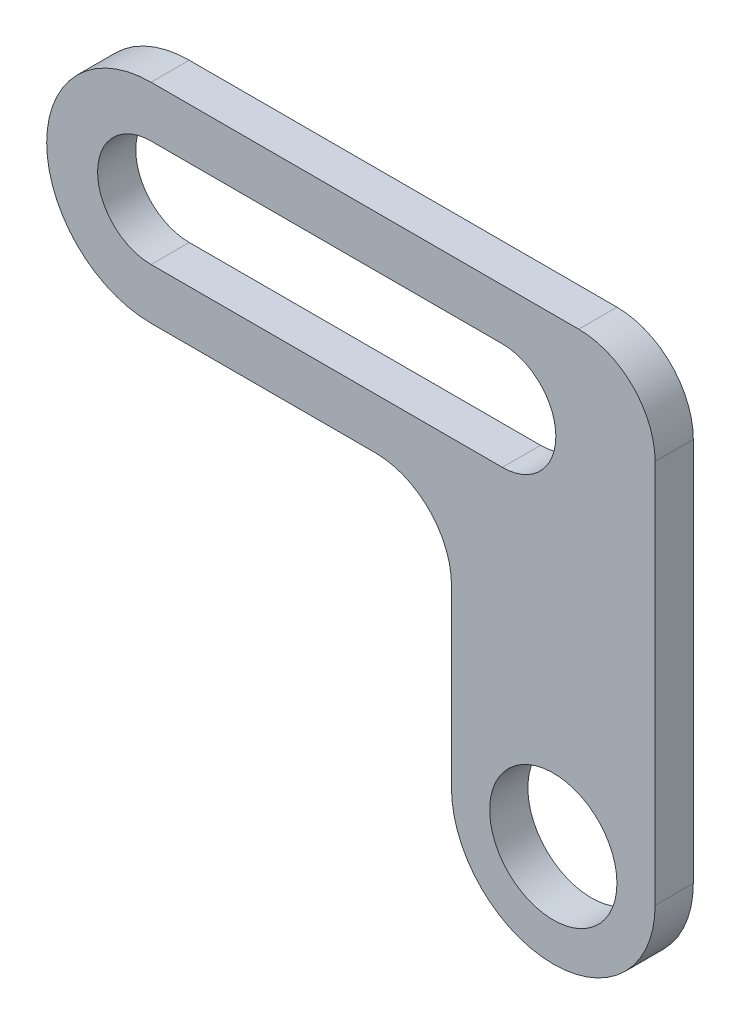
ISO-10303-21;
HEADER;
FILE_DESCRIPTION(('STEP AP214'),'2;1');
FILE_NAME('part.step','',(''),(''),'','','');
FILE_SCHEMA(('AUTOMOTIVE_DESIGN { 1 0 10303 214 1 1 1 1 }'));
ENDSEC;
DATA;
#1=APPLICATION_CONTEXT('core data for automotive mechanical design processes');
#2=APPLICATION_PROTOCOL_DEFINITION('international standard','automotive_design',2000,#1);
#3=PRODUCT_CONTEXT('',#1,'mechanical');
#4=PRODUCT('Part','Part','',(#3));
#5=PRODUCT_RELATED_PRODUCT_CATEGORY('part','',(#4));
#6=PRODUCT_DEFINITION_FORMATION('','',#4);
#7=PRODUCT_DEFINITION_CONTEXT('part definition',#1,'design');
#8=PRODUCT_DEFINITION('design','',#6,#7);
#9=PRODUCT_DEFINITION_SHAPE('','',#8);
#10=(LENGTH_UNIT() NAMED_UNIT(*) SI_UNIT(.MILLI.,.METRE.));
#11=(NAMED_UNIT(*) PLANE_ANGLE_UNIT() SI_UNIT($,.RADIAN.));
#12=(NAMED_UNIT(*) SI_UNIT($,.STERADIAN.) SOLID_ANGLE_UNIT());
#13=UNCERTAINTY_MEASURE_WITH_UNIT(LENGTH_MEASURE(1.E-05),#10,'distance_accuracy_value','');
#14=(GEOMETRIC_REPRESENTATION_CONTEXT(3) GLOBAL_UNCERTAINTY_ASSIGNED_CONTEXT((#13)) GLOBAL_UNIT_ASSIGNED_CONTEXT((#10,
#11,#12)) REPRESENTATION_CONTEXT('',''));
#15=CARTESIAN_POINT('',(0.,0.,0.));
#16=DIRECTION('',(0.,0.,1.));
#17=DIRECTION('',(1.,0.,0.));
#18=AXIS2_PLACEMENT_3D('',#15,#16,#17);
#19=CARTESIAN_POINT('',(0.,0.,15.));
#20=DIRECTION('',(0.,0.,1.));
#21=DIRECTION('',(1.,0.,0.));
#22=AXIS2_PLACEMENT_3D('',#19,#20,#21);
#23=PLANE('',#22);
#24=DIRECTION('',(1.,0.,0.));
#25=VECTOR('',#24,1.);
#26=CARTESIAN_POINT('',(-158.,119.,15.));
#27=LINE('',#26,#25);
#28=CARTESIAN_POINT('',(-158.,119.,15.));
#29=VERTEX_POINT('',#28);
#30=CARTESIAN_POINT('',(-20.,119.,15.));
#31=VERTEX_POINT('',#30);
#32=EDGE_CURVE('E132',#29,#31,#27,.T.);
#33=ORIENTED_EDGE('',*,*,#32,.F.);
#34=CARTESIAN_POINT('',(-158.,140.,15.));
#35=DIRECTION('',(0.,0.,1.));
#36=DIRECTION('',(1.,0.,0.));
#37=AXIS2_PLACEMENT_3D('',#34,#35,#36);
#38=CIRCLE('',#37,21.);
#39=CARTESIAN_POINT('',(-158.,161.,15.));
#40=VERTEX_POINT('',#39);
#41=EDGE_CURVE('E122',#40,#29,#38,.T.);
#42=ORIENTED_EDGE('',*,*,#41,.F.);
#43=DIRECTION('',(-1.,0.,0.));
#44=VECTOR('',#43,1.);
#45=CARTESIAN_POINT('',(-158.,161.,15.));
#46=LINE('',#45,#44);
#47=CARTESIAN_POINT('',(-20.,161.,15.));
#48=VERTEX_POINT('',#47);
#49=EDGE_CURVE('E148',#48,#40,#46,.T.);
#50=ORIENTED_EDGE('',*,*,#49,.F.);
#51=CARTESIAN_POINT('',(-20.,140.,15.));
#52=DIRECTION('',(0.,0.,1.));
#53=DIRECTION('',(1.,0.,0.));
#54=AXIS2_PLACEMENT_3D('',#51,#52,#53);
#55=CIRCLE('',#54,21.);
#56=EDGE_CURVE('E146',#31,#48,#55,.T.);
#57=ORIENTED_EDGE('',*,*,#56,.F.);
#58=EDGE_LOOP('',(#33,#42,#50,#57));
#59=FACE_BOUND('',#58,.T.);
#60=DIRECTION('',(0.,1.,0.));
#61=VECTOR('',#60,1.);
#62=CARTESIAN_POINT('',(40.,0.,15.));
#63=LINE('',#62,#61);
#64=CARTESIAN_POINT('',(40.,0.,15.));
#65=VERTEX_POINT('',#64);
#66=CARTESIAN_POINT('',(40.,151.,15.));
#67=VERTEX_POINT('',#66);
#68=EDGE_CURVE('E169',#65,#67,#63,.T.);
#69=ORIENTED_EDGE('',*,*,#68,.T.);
#70=CARTESIAN_POINT('',(10.,151.,15.));
#71=DIRECTION('',(0.,0.,1.));
#72=DIRECTION('',(1.,0.,0.));
#73=AXIS2_PLACEMENT_3D('',#70,#71,#72);
#74=CIRCLE('',#73,30.);
#75=CARTESIAN_POINT('',(10.,181.,15.));
#76=VERTEX_POINT('',#75);
#77=EDGE_CURVE('E215',#67,#76,#74,.T.);
#78=ORIENTED_EDGE('',*,*,#77,.T.);
#79=DIRECTION('',(-1.,0.,0.));
#80=VECTOR('',#79,1.);
#81=CARTESIAN_POINT('',(40.,181.,15.));
#82=LINE('',#81,#80);
#83=CARTESIAN_POINT('',(-158.,181.,15.));
#84=VERTEX_POINT('',#83);
#85=EDGE_CURVE('E172',#76,#84,#82,.T.);
#86=ORIENTED_EDGE('',*,*,#85,.T.);
#87=CARTESIAN_POINT('',(-158.,140.,15.));
#88=DIRECTION('',(0.,0.,1.));
#89=DIRECTION('',(1.,0.,0.));
#90=AXIS2_PLACEMENT_3D('',#87,#88,#89);
#91=CIRCLE('',#90,40.9999999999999);
#92=CARTESIAN_POINT('',(-158.,99.0000000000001,15.));
#93=VERTEX_POINT('',#92);
#94=EDGE_CURVE('E174',#84,#93,#91,.T.);
#95=ORIENTED_EDGE('',*,*,#94,.T.);
#96=DIRECTION('',(1.,0.,0.));
#97=VECTOR('',#96,1.);
#98=CARTESIAN_POINT('',(-158.,99.0000000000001,15.));
#99=LINE('',#98,#97);
#100=CARTESIAN_POINT('',(-70.,99.0000000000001,15.));
#101=VERTEX_POINT('',#100);
#102=EDGE_CURVE('E176',#93,#101,#99,.T.);
#103=ORIENTED_EDGE('',*,*,#102,.T.);
#104=CARTESIAN_POINT('',(-70.,69.0000000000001,15.));
#105=DIRECTION('',(0.,0.,1.));
#106=DIRECTION('',(1.,0.,0.));
#107=AXIS2_PLACEMENT_3D('',#104,#105,#106);
#108=CIRCLE('',#107,30.);
#109=CARTESIAN_POINT('',(-40.,69.0000000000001,15.));
#110=VERTEX_POINT('',#109);
#111=EDGE_CURVE('E11',#101,#110,#108,.F.);
#112=ORIENTED_EDGE('',*,*,#111,.T.);
#113=DIRECTION('',(0.,-1.,0.));
#114=VECTOR('',#113,1.);
#115=CARTESIAN_POINT('',(-40.,99.0000000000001,15.));
#116=LINE('',#115,#114);
#117=CARTESIAN_POINT('',(-40.,0.,15.));
#118=VERTEX_POINT('',#117);
#119=EDGE_CURVE('E179',#110,#118,#116,.T.);
#120=ORIENTED_EDGE('',*,*,#119,.T.);
#121=CARTESIAN_POINT('',(0.,0.,15.));
#122=DIRECTION('',(0.,0.,1.));
#123=DIRECTION('',(1.,0.,0.));
#124=AXIS2_PLACEMENT_3D('',#121,#122,#123);
#125=CIRCLE('',#124,40.);
#126=EDGE_CURVE('E166',#118,#65,#125,.T.);
#127=ORIENTED_EDGE('',*,*,#126,.T.);
#128=EDGE_LOOP('',(#69,#78,#86,#95,#103,#112,#120,#127));
#129=FACE_BOUND('',#128,.T.);
#130=CARTESIAN_POINT('',(0.,0.,15.));
#131=DIRECTION('',(0.,0.,1.));
#132=DIRECTION('',(1.,0.,0.));
#133=AXIS2_PLACEMENT_3D('',#130,#131,#132);
#134=CIRCLE('',#133,25.);
#135=CARTESIAN_POINT('',(25.,0.,15.));
#136=VERTEX_POINT('',#135);
#137=EDGE_CURVE('E155',#136,#136,#134,.T.);
#138=ORIENTED_EDGE('',*,*,#137,.F.);
#139=EDGE_LOOP('',(#138));
#140=FACE_BOUND('',#139,.T.);
#141=ADVANCED_FACE('F33',(#59,#129,#140),#23,.T.);
#142=CARTESIAN_POINT('',(0.,0.,0.));
#143=DIRECTION('',(0.,0.,1.));
#144=DIRECTION('',(1.,0.,0.));
#145=AXIS2_PLACEMENT_3D('',#142,#143,#144);
#146=PLANE('',#145);
#147=DIRECTION('',(-1.,0.,0.));
#148=VECTOR('',#147,1.);
#149=CARTESIAN_POINT('',(40.,181.,0.));
#150=LINE('',#149,#148);
#151=CARTESIAN_POINT('',(10.,181.,0.));
#152=VERTEX_POINT('',#151);
#153=CARTESIAN_POINT('',(-158.,181.,0.));
#154=VERTEX_POINT('',#153);
#155=EDGE_CURVE('E186',#152,#154,#150,.T.);
#156=ORIENTED_EDGE('',*,*,#155,.F.);
#157=CARTESIAN_POINT('',(10.,151.,0.));
#158=DIRECTION('',(0.,0.,1.));
#159=DIRECTION('',(1.,0.,0.));
#160=AXIS2_PLACEMENT_3D('',#157,#158,#159);
#161=CIRCLE('',#160,30.);
#162=CARTESIAN_POINT('',(40.,151.,0.));
#163=VERTEX_POINT('',#162);
#164=EDGE_CURVE('E56',#152,#163,#161,.F.);
#165=ORIENTED_EDGE('',*,*,#164,.T.);
#166=DIRECTION('',(0.,1.,0.));
#167=VECTOR('',#166,1.);
#168=CARTESIAN_POINT('',(40.,0.,0.));
#169=LINE('',#168,#167);
#170=CARTESIAN_POINT('',(40.,0.,0.));
#171=VERTEX_POINT('',#170);
#172=EDGE_CURVE('E184',#171,#163,#169,.T.);
#173=ORIENTED_EDGE('',*,*,#172,.F.);
#174=CARTESIAN_POINT('',(0.,0.,0.));
#175=DIRECTION('',(0.,0.,1.));
#176=DIRECTION('',(1.,0.,0.));
#177=AXIS2_PLACEMENT_3D('',#174,#175,#176);
#178=CIRCLE('',#177,40.);
#179=CARTESIAN_POINT('',(-40.,0.,0.));
#180=VERTEX_POINT('',#179);
#181=EDGE_CURVE('E140',#180,#171,#178,.T.);
#182=ORIENTED_EDGE('',*,*,#181,.F.);
#183=DIRECTION('',(0.,-1.,0.));
#184=VECTOR('',#183,1.);
#185=CARTESIAN_POINT('',(-40.,99.0000000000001,0.));
#186=LINE('',#185,#184);
#187=CARTESIAN_POINT('',(-40.,69.0000000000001,0.));
#188=VERTEX_POINT('',#187);
#189=EDGE_CURVE('E170',#188,#180,#186,.T.);
#190=ORIENTED_EDGE('',*,*,#189,.F.);
#191=CARTESIAN_POINT('',(-70.,69.0000000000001,0.));
#192=DIRECTION('',(0.,0.,1.));
#193=DIRECTION('',(1.,0.,0.));
#194=AXIS2_PLACEMENT_3D('',#191,#192,#193);
#195=CIRCLE('',#194,30.);
#196=CARTESIAN_POINT('',(-70.,99.0000000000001,0.));
#197=VERTEX_POINT('',#196);
#198=EDGE_CURVE('E41',#188,#197,#195,.T.);
#199=ORIENTED_EDGE('',*,*,#198,.T.);
#200=DIRECTION('',(1.,0.,0.));
#201=VECTOR('',#200,1.);
#202=CARTESIAN_POINT('',(-158.,99.0000000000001,0.));
#203=LINE('',#202,#201);
#204=CARTESIAN_POINT('',(-158.,99.0000000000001,0.));
#205=VERTEX_POINT('',#204);
#206=EDGE_CURVE('E190',#205,#197,#203,.T.);
#207=ORIENTED_EDGE('',*,*,#206,.F.);
#208=CARTESIAN_POINT('',(-158.,140.,0.));
#209=DIRECTION('',(0.,0.,1.));
#210=DIRECTION('',(1.,0.,0.));
#211=AXIS2_PLACEMENT_3D('',#208,#209,#210);
#212=CIRCLE('',#211,40.9999999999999);
#213=EDGE_CURVE('E188',#154,#205,#212,.T.);
#214=ORIENTED_EDGE('',*,*,#213,.F.);
#215=EDGE_LOOP('',(#156,#165,#173,#182,#190,#199,#207,#214));
#216=FACE_BOUND('',#215,.T.);
#217=CARTESIAN_POINT('',(-158.,140.,0.));
#218=DIRECTION('',(0.,0.,1.));
#219=DIRECTION('',(1.,0.,0.));
#220=AXIS2_PLACEMENT_3D('',#217,#218,#219);
#221=CIRCLE('',#220,21.);
#222=CARTESIAN_POINT('',(-158.,161.,0.));
#223=VERTEX_POINT('',#222);
#224=CARTESIAN_POINT('',(-158.,119.,0.));
#225=VERTEX_POINT('',#224);
#226=EDGE_CURVE('E153',#223,#225,#221,.T.);
#227=ORIENTED_EDGE('',*,*,#226,.T.);
#228=DIRECTION('',(1.,0.,0.));
#229=VECTOR('',#228,1.);
#230=CARTESIAN_POINT('',(-158.,119.,0.));
#231=LINE('',#230,#229);
#232=CARTESIAN_POINT('',(-20.,119.,0.));
#233=VERTEX_POINT('',#232);
#234=EDGE_CURVE('E139',#225,#233,#231,.T.);
#235=ORIENTED_EDGE('',*,*,#234,.T.);
#236=CARTESIAN_POINT('',(-20.,140.,0.));
#237=DIRECTION('',(0.,0.,1.));
#238=DIRECTION('',(1.,0.,0.));
#239=AXIS2_PLACEMENT_3D('',#236,#237,#238);
#240=CIRCLE('',#239,21.);
#241=CARTESIAN_POINT('',(-20.,161.,0.));
#242=VERTEX_POINT('',#241);
#243=EDGE_CURVE('E157',#233,#242,#240,.T.);
#244=ORIENTED_EDGE('',*,*,#243,.T.);
#245=DIRECTION('',(-1.,0.,0.));
#246=VECTOR('',#245,1.);
#247=CARTESIAN_POINT('',(-158.,161.,0.));
#248=LINE('',#247,#246);
#249=EDGE_CURVE('E133',#242,#223,#248,.T.);
#250=ORIENTED_EDGE('',*,*,#249,.T.);
#251=EDGE_LOOP('',(#227,#235,#244,#250));
#252=FACE_BOUND('',#251,.T.);
#253=CARTESIAN_POINT('',(0.,0.,0.));
#254=DIRECTION('',(0.,0.,1.));
#255=DIRECTION('',(1.,0.,0.));
#256=AXIS2_PLACEMENT_3D('',#253,#254,#255);
#257=CIRCLE('',#256,25.);
#258=CARTESIAN_POINT('',(25.,0.,0.));
#259=VERTEX_POINT('',#258);
#260=EDGE_CURVE('E297',#259,#259,#257,.T.);
#261=ORIENTED_EDGE('',*,*,#260,.T.);
#262=EDGE_LOOP('',(#261));
#263=FACE_BOUND('',#262,.T.);
#264=ADVANCED_FACE('F218',(#216,#252,#263),#146,.F.);
#265=CARTESIAN_POINT('',(0.,0.,15.));
#266=DIRECTION('',(0.,0.,-1.));
#267=DIRECTION('',(-1.,0.,0.));
#268=AXIS2_PLACEMENT_3D('',#265,#266,#267);
#269=CYLINDRICAL_SURFACE('',#268,40.);
#270=ORIENTED_EDGE('',*,*,#181,.T.);
#271=DIRECTION('',(0.,0.,-1.));
#272=VECTOR('',#271,1.);
#273=CARTESIAN_POINT('',(40.,0.,15.));
#274=LINE('',#273,#272);
#275=EDGE_CURVE('E202',#65,#171,#274,.T.);
#276=ORIENTED_EDGE('',*,*,#275,.F.);
#277=ORIENTED_EDGE('',*,*,#126,.F.);
#278=DIRECTION('',(0.,0.,-1.));
#279=VECTOR('',#278,1.);
#280=CARTESIAN_POINT('',(-40.,0.,15.));
#281=LINE('',#280,#279);
#282=EDGE_CURVE('E181',#118,#180,#281,.T.);
#283=ORIENTED_EDGE('',*,*,#282,.T.);
#284=EDGE_LOOP('',(#270,#276,#277,#283));
#285=FACE_BOUND('',#284,.T.);
#286=ADVANCED_FACE('F239',(#285),#269,.T.);
#287=CARTESIAN_POINT('',(40.,0.,15.));
#288=DIRECTION('',(-1.,0.,0.));
#289=DIRECTION('',(0.,-1.,0.));
#290=AXIS2_PLACEMENT_3D('',#287,#288,#289);
#291=PLANE('',#290);
#292=ORIENTED_EDGE('',*,*,#172,.T.);
#293=DIRECTION('',(0.,0.,-1.));
#294=VECTOR('',#293,1.);
#295=CARTESIAN_POINT('',(40.,151.,15.));
#296=LINE('',#295,#294);
#297=EDGE_CURVE('E48',#163,#67,#296,.F.);
#298=ORIENTED_EDGE('',*,*,#297,.T.);
#299=ORIENTED_EDGE('',*,*,#68,.F.);
#300=ORIENTED_EDGE('',*,*,#275,.T.);
#301=EDGE_LOOP('',(#292,#298,#299,#300));
#302=FACE_BOUND('',#301,.T.);
#303=ADVANCED_FACE('F257',(#302),#291,.F.);
#304=CARTESIAN_POINT('',(40.,181.,15.));
#305=DIRECTION('',(0.,-1.,0.));
#306=DIRECTION('',(1.,0.,0.));
#307=AXIS2_PLACEMENT_3D('',#304,#305,#306);
#308=PLANE('',#307);
#309=ORIENTED_EDGE('',*,*,#85,.F.);
#310=DIRECTION('',(0.,0.,-1.));
#311=VECTOR('',#310,1.);
#312=CARTESIAN_POINT('',(10.,181.,15.));
#313=LINE('',#312,#311);
#314=EDGE_CURVE('E210',#76,#152,#313,.T.);
#315=ORIENTED_EDGE('',*,*,#314,.T.);
#316=ORIENTED_EDGE('',*,*,#155,.T.);
#317=DIRECTION('',(0.,0.,-1.));
#318=VECTOR('',#317,1.);
#319=CARTESIAN_POINT('',(-158.,181.,15.));
#320=LINE('',#319,#318);
#321=EDGE_CURVE('E199',#84,#154,#320,.T.);
#322=ORIENTED_EDGE('',*,*,#321,.F.);
#323=EDGE_LOOP('',(#309,#315,#316,#322));
#324=FACE_BOUND('',#323,.T.);
#325=ADVANCED_FACE('F245',(#324),#308,.F.);
#326=CARTESIAN_POINT('',(-158.,140.,15.));
#327=DIRECTION('',(0.,0.,-1.));
#328=DIRECTION('',(-1.,0.,0.));
#329=AXIS2_PLACEMENT_3D('',#326,#327,#328);
#330=CYLINDRICAL_SURFACE('',#329,40.9999999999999);
#331=ORIENTED_EDGE('',*,*,#213,.T.);
#332=DIRECTION('',(0.,0.,-1.));
#333=VECTOR('',#332,1.);
#334=CARTESIAN_POINT('',(-158.,99.0000000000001,15.));
#335=LINE('',#334,#333);
#336=EDGE_CURVE('E196',#93,#205,#335,.T.);
#337=ORIENTED_EDGE('',*,*,#336,.F.);
#338=ORIENTED_EDGE('',*,*,#94,.F.);
#339=ORIENTED_EDGE('',*,*,#321,.T.);
#340=EDGE_LOOP('',(#331,#337,#338,#339));
#341=FACE_BOUND('',#340,.T.);
#342=ADVANCED_FACE('F248',(#341),#330,.T.);
#343=CARTESIAN_POINT('',(-158.,99.0000000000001,15.));
#344=DIRECTION('',(0.,1.,0.));
#345=DIRECTION('',(0.,0.,1.));
#346=AXIS2_PLACEMENT_3D('',#343,#344,#345);
#347=PLANE('',#346);
#348=ORIENTED_EDGE('',*,*,#206,.T.);
#349=DIRECTION('',(0.,0.,-1.));
#350=VECTOR('',#349,1.);
#351=CARTESIAN_POINT('',(-70.,99.0000000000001,15.));
#352=LINE('',#351,#350);
#353=EDGE_CURVE('E208',#197,#101,#352,.F.);
#354=ORIENTED_EDGE('',*,*,#353,.T.);
#355=ORIENTED_EDGE('',*,*,#102,.F.);
#356=ORIENTED_EDGE('',*,*,#336,.T.);
#357=EDGE_LOOP('',(#348,#354,#355,#356));
#358=FACE_BOUND('',#357,.T.);
#359=ADVANCED_FACE('F226',(#358),#347,.F.);
#360=CARTESIAN_POINT('',(-40.,99.0000000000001,15.));
#361=DIRECTION('',(1.,0.,0.));
#362=DIRECTION('',(0.,1.,0.));
#363=AXIS2_PLACEMENT_3D('',#360,#361,#362);
#364=PLANE('',#363);
#365=ORIENTED_EDGE('',*,*,#119,.F.);
#366=DIRECTION('',(0.,0.,-1.));
#367=VECTOR('',#366,1.);
#368=CARTESIAN_POINT('',(-40.,69.0000000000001,0.));
#369=LINE('',#368,#367);
#370=EDGE_CURVE('E205',#110,#188,#369,.T.);
#371=ORIENTED_EDGE('',*,*,#370,.T.);
#372=ORIENTED_EDGE('',*,*,#189,.T.);
#373=ORIENTED_EDGE('',*,*,#282,.F.);
#374=EDGE_LOOP('',(#365,#371,#372,#373));
#375=FACE_BOUND('',#374,.T.);
#376=ADVANCED_FACE('F235',(#375),#364,.F.);
#377=CARTESIAN_POINT('',(-158.,140.,15.));
#378=DIRECTION('',(0.,0.,-1.));
#379=DIRECTION('',(-1.,0.,0.));
#380=AXIS2_PLACEMENT_3D('',#377,#378,#379);
#381=CYLINDRICAL_SURFACE('',#380,21.);
#382=ORIENTED_EDGE('',*,*,#226,.F.);
#383=DIRECTION('',(0.,0.,-1.));
#384=VECTOR('',#383,1.);
#385=CARTESIAN_POINT('',(-158.,161.,15.));
#386=LINE('',#385,#384);
#387=EDGE_CURVE('E128',#40,#223,#386,.T.);
#388=ORIENTED_EDGE('',*,*,#387,.F.);
#389=ORIENTED_EDGE('',*,*,#41,.T.);
#390=DIRECTION('',(0.,0.,-1.));
#391=VECTOR('',#390,1.);
#392=CARTESIAN_POINT('',(-158.,119.,15.));
#393=LINE('',#392,#391);
#394=EDGE_CURVE('E125',#29,#225,#393,.T.);
#395=ORIENTED_EDGE('',*,*,#394,.T.);
#396=EDGE_LOOP('',(#382,#388,#389,#395));
#397=FACE_BOUND('',#396,.T.);
#398=ADVANCED_FACE('F124',(#397),#381,.F.);
#399=CARTESIAN_POINT('',(-158.,119.,15.));
#400=DIRECTION('',(0.,1.,0.));
#401=DIRECTION('',(0.,0.,1.));
#402=AXIS2_PLACEMENT_3D('',#399,#400,#401);
#403=PLANE('',#402);
#404=ORIENTED_EDGE('',*,*,#234,.F.);
#405=ORIENTED_EDGE('',*,*,#394,.F.);
#406=ORIENTED_EDGE('',*,*,#32,.T.);
#407=DIRECTION('',(0.,0.,-1.));
#408=VECTOR('',#407,1.);
#409=CARTESIAN_POINT('',(-20.,119.,15.));
#410=LINE('',#409,#408);
#411=EDGE_CURVE('E141',#31,#233,#410,.T.);
#412=ORIENTED_EDGE('',*,*,#411,.T.);
#413=EDGE_LOOP('',(#404,#405,#406,#412));
#414=FACE_BOUND('',#413,.T.);
#415=ADVANCED_FACE('F136',(#414),#403,.T.);
#416=CARTESIAN_POINT('',(-20.,140.,15.));
#417=DIRECTION('',(0.,0.,-1.));
#418=DIRECTION('',(-1.,0.,0.));
#419=AXIS2_PLACEMENT_3D('',#416,#417,#418);
#420=CYLINDRICAL_SURFACE('',#419,21.);
#421=ORIENTED_EDGE('',*,*,#243,.F.);
#422=ORIENTED_EDGE('',*,*,#411,.F.);
#423=ORIENTED_EDGE('',*,*,#56,.T.);
#424=DIRECTION('',(0.,0.,-1.));
#425=VECTOR('',#424,1.);
#426=CARTESIAN_POINT('',(-20.,161.,15.));
#427=LINE('',#426,#425);
#428=EDGE_CURVE('E163',#48,#242,#427,.T.);
#429=ORIENTED_EDGE('',*,*,#428,.T.);
#430=EDGE_LOOP('',(#421,#422,#423,#429));
#431=FACE_BOUND('',#430,.T.);
#432=ADVANCED_FACE('F275',(#431),#420,.F.);
#433=CARTESIAN_POINT('',(-158.,161.,15.));
#434=DIRECTION('',(0.,-1.,0.));
#435=DIRECTION('',(0.,0.,-1.));
#436=AXIS2_PLACEMENT_3D('',#433,#434,#435);
#437=PLANE('',#436);
#438=ORIENTED_EDGE('',*,*,#249,.F.);
#439=ORIENTED_EDGE('',*,*,#428,.F.);
#440=ORIENTED_EDGE('',*,*,#49,.T.);
#441=ORIENTED_EDGE('',*,*,#387,.T.);
#442=EDGE_LOOP('',(#438,#439,#440,#441));
#443=FACE_BOUND('',#442,.T.);
#444=ADVANCED_FACE('F279',(#443),#437,.T.);
#445=CARTESIAN_POINT('',(0.,0.,15.));
#446=DIRECTION('',(0.,0.,-1.));
#447=DIRECTION('',(-1.,0.,0.));
#448=AXIS2_PLACEMENT_3D('',#445,#446,#447);
#449=CYLINDRICAL_SURFACE('',#448,25.);
#450=ORIENTED_EDGE('',*,*,#137,.T.);
#451=EDGE_LOOP('',(#450));
#452=FACE_BOUND('',#451,.T.);
#453=ORIENTED_EDGE('',*,*,#260,.F.);
#454=EDGE_LOOP('',(#453));
#455=FACE_BOUND('',#454,.T.);
#456=ADVANCED_FACE('F285',(#452,#455),#449,.F.);
#457=CARTESIAN_POINT('',(-70.,69.0000000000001,15.));
#458=DIRECTION('',(0.,0.,1.));
#459=DIRECTION('',(1.,0.,0.));
#460=AXIS2_PLACEMENT_3D('',#457,#458,#459);
#461=CYLINDRICAL_SURFACE('',#460,30.);
#462=ORIENTED_EDGE('',*,*,#111,.F.);
#463=ORIENTED_EDGE('',*,*,#353,.F.);
#464=ORIENTED_EDGE('',*,*,#198,.F.);
#465=ORIENTED_EDGE('',*,*,#370,.F.);
#466=EDGE_LOOP('',(#462,#463,#464,#465));
#467=FACE_BOUND('',#466,.T.);
#468=ADVANCED_FACE('F230',(#467),#461,.F.);
#469=CARTESIAN_POINT('',(10.,151.,15.));
#470=DIRECTION('',(0.,0.,-1.));
#471=DIRECTION('',(-1.,0.,0.));
#472=AXIS2_PLACEMENT_3D('',#469,#470,#471);
#473=CYLINDRICAL_SURFACE('',#472,30.);
#474=ORIENTED_EDGE('',*,*,#77,.F.);
#475=ORIENTED_EDGE('',*,*,#297,.F.);
#476=ORIENTED_EDGE('',*,*,#164,.F.);
#477=ORIENTED_EDGE('',*,*,#314,.F.);
#478=EDGE_LOOP('',(#474,#475,#476,#477));
#479=FACE_BOUND('',#478,.T.);
#480=ADVANCED_FACE('F35',(#479),#473,.T.);
#481=CLOSED_SHELL('',(#141,#264,#286,#303,#325,#342,#359,#376,#398,#415,#432,#444,#456,#468,#480));
#482=MANIFOLD_SOLID_BREP('B2',#481);
#483=ADVANCED_BREP_SHAPE_REPRESENTATION('',(#18,#482),#14);
#484=SHAPE_DEFINITION_REPRESENTATION(#9,#483);
ENDSEC;
END-ISO-10303-21;
